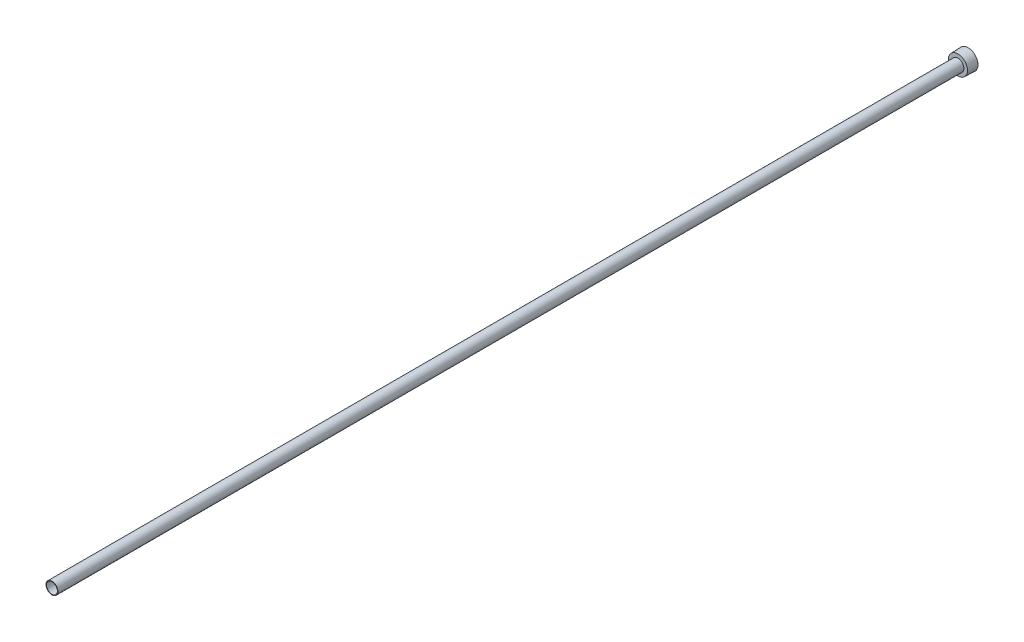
from build123d import *

# Parameters (mm, degrees)
SKETCH2_R          = 7.2263
CUT_EXTRUDE1_DEPTH = 1220.343353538
CUT_EXTRUDE2_DEPTH = 9.525


with BuildPart() as part:
    # Sketch1 → Revolve1 (revolve)
    with BuildSketch(Plane(origin=(0, 0, 0), x_dir=(0, 0, -1), z_dir=(1, 0, 0)), mode=Mode.PRIVATE) as revolve1_sk:
        Polygon((-1219.2, 0), (0, 0), (0, 13.2207), (-13.4874, 12.728732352), (-13.4874, 7.9375), (-1219.2, 7.9375), align=None)
    revolve(revolve1_sk.sketch.rotate(Axis((0, 0, 278.001114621), (0, 0, -1)), 90), axis=Axis((0, 0, 278.001114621), (0, 0, -1)))

    # Sketch2 → Cut-Extrude1 (cut, through all)
    with BuildSketch(Plane.XY.offset(1219.2)):
        Circle(SKETCH2_R)
    extrude(amount=-CUT_EXTRUDE1_DEPTH, mode=Mode.SUBTRACT)

    # Sketch3 → Cut-Extrude2 (cut)
    with BuildSketch(Plane(origin=(0, 0, 0), x_dir=(-1, 0, 0), z_dir=(0, 0, -1))):
        Polygon((0, -10.998522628), (9.525, -5.499261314), (9.525, 5.499261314), (0, 10.998522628), (-9.525, 5.499261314), (-9.525, -5.499261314), align=None)
    extrude(amount=-CUT_EXTRUDE2_DEPTH, mode=Mode.SUBTRACT)


solid = part.part
